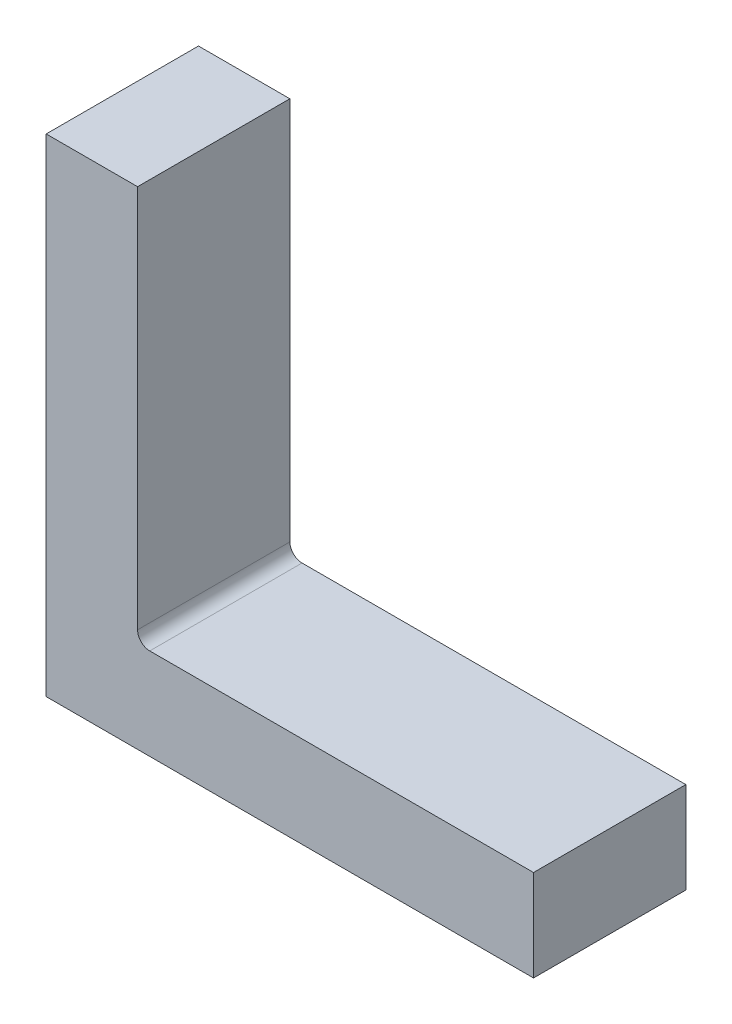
from build123d import *

# Parameters (mm, degrees)
EXTRUDE1_DEPTH = 31.75
FILLET1_R      = 2.54


with BuildPart() as part:
    # Sketch1 → Extrude1 (new body)
    with BuildSketch(Plane.XY):
        Polygon((19.05, 101.6), (19.05, 19.05), (101.6, 19.05), (101.6, 0), (0, 0), (0, 101.6), align=None)
    extrude(amount=EXTRUDE1_DEPTH)

    # Fillet1
    fillet1_edges = [part.edges().sort_by_distance(p)[0] for p in [
        (19.05, 19.05, 15.875),
    ]]
    fillet(fillet1_edges, radius=FILLET1_R)


solid = part.part
